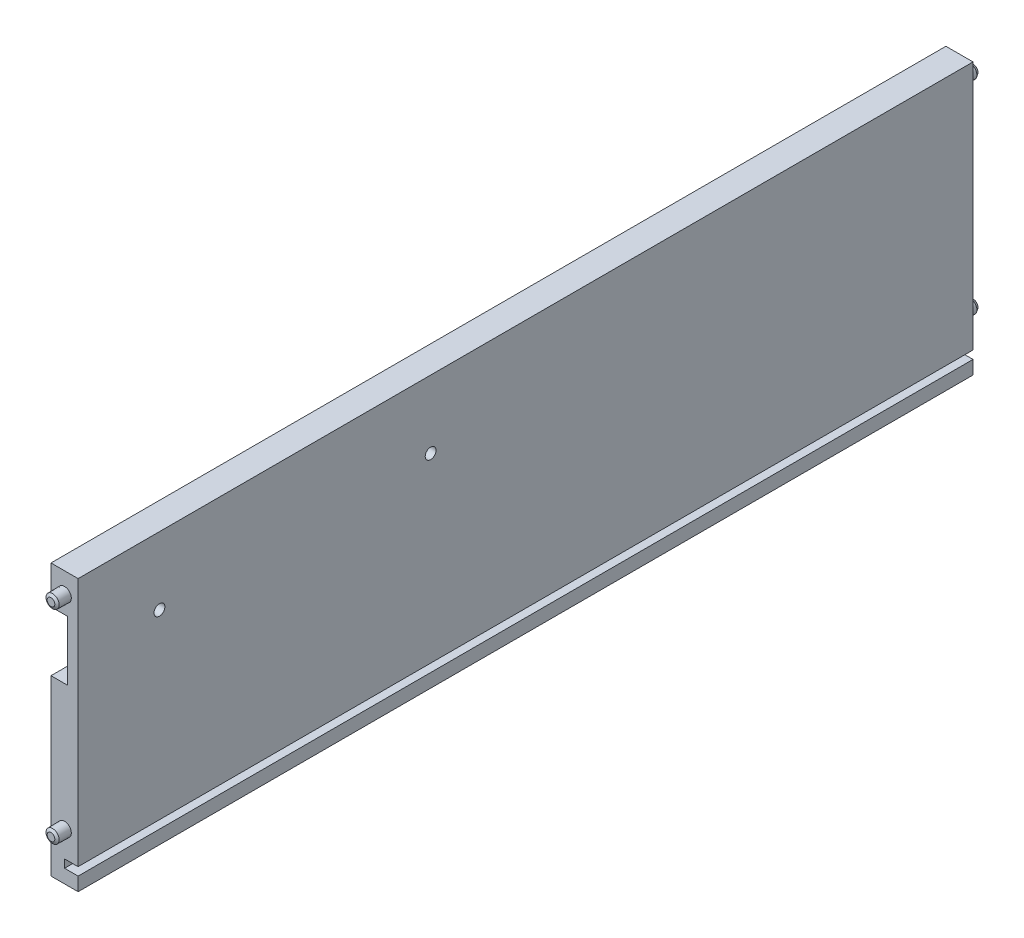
from build123d import *
from OCP.BRepFilletAPI import BRepFilletAPI_MakeChamfer

# Parameters (mm, degrees)
SKETCH1_W                     = 330
SKETCH1_H                     = 100
BOSS_EXTRUDE1_DEPTH           = 10
SKETCH2_W                     = 330
SKETCH2_H                     = 22
CUT_EXTRUDE1_DEPTH            = 6
SKETCH3_R                     = 2
CUT_EXTRUDE2_DEPTH            = 10
SKETCH4_R                     = 2.5
BOSS_EXTRUDE2_DEPTH           = 5
BOSS_EXTRUDE2_DRAFT           = 1
BOSS_EXTRUDE2_PROFILE_2_DEPTH = 5
BOSS_EXTRUDE2_PROFILE_2_DRAFT = 1
MIRROR1_COPY_1_SKETCH_R       = 2.5
MIRROR1_COPY_1_DEPTH          = 5
MIRROR1_COPY_1_DRAFT          = 1
MIRROR1_COPY_2_SKETCH_R       = 2.5
MIRROR1_COPY_2_DEPTH          = 5
MIRROR1_COPY_2_DRAFT          = 1
MIRROR1_COPY_3_SKETCH_R       = 2.5
MIRROR1_COPY_3_DEPTH          = 5
MIRROR1_COPY_3_DRAFT          = 1
CHAMFER1_SIZE                 = 1
CHAMFER1_SIZE2                = 0.583316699
SKETCH5_W                     = 330
SKETCH5_H                     = 3
CUT_EXTRUDE3_DEPTH            = 5


with BuildPart() as part:
    # Sketch1 → Boss-Extrude1 (new body)
    with BuildSketch(Plane(origin=(0, 0, 0), x_dir=(0, 0, -1), z_dir=(1, 0, 0))):
        Rectangle(SKETCH1_W, SKETCH1_H)
    extrude(amount=BOSS_EXTRUDE1_DEPTH)

    # Sketch2 → Cut-Extrude1 (cut)
    with BuildSketch(Plane.ZY):
        with Locations((0, 25)):
            Rectangle(SKETCH2_W, SKETCH2_H)
    extrude(amount=-CUT_EXTRUDE1_DEPTH, mode=Mode.SUBTRACT)

    # Sketch3 → Cut-Extrude2 (cut)
    with BuildSketch(Plane.ZY.offset(-6)):
        with Locations((35, 25)):
            Circle(SKETCH3_R)
        with Locations((135, 25)):
            Circle(SKETCH3_R)
    extrude(amount=-CUT_EXTRUDE2_DEPTH, mode=Mode.SUBTRACT)


with BuildPart() as boss_extrude2_tool:
    # Sketch4 → Boss-Extrude2 (with draft: the straight prism first)
    with BuildSketch(Plane(origin=(0, 0, -165), x_dir=(-1, 0, 0), z_dir=(0, 0, -1))):
        with Locations((-5, 42.5)):
            Circle(SKETCH4_R)
    extrude(amount=BOSS_EXTRUDE2_DEPTH)
    # Boss-Extrude2: the draft: its side faces are tilted about the plane it starts from
    boss_extrude2_sides = [boss_extrude2_tool.faces().sort_by_distance(p)[0] for p in [
        (7.5, 42.5, -167.5),
    ]]
    draft(boss_extrude2_sides, Plane(origin=(0, 0, -165), x_dir=(-1, 0, 0), z_dir=(0, 0, -1)), BOSS_EXTRUDE2_DRAFT)


with BuildPart() as part_1:
    add(part.part)

    # Boss-Extrude2: add boss_extrude2_tool
    add(boss_extrude2_tool.part)


with BuildPart() as boss_extrude2_profile_2_tool:
    # Sketch4 → Boss-Extrude2 profile 2 (with draft: the straight prism first)
    with BuildSketch(Plane(origin=(0, 0, -165), x_dir=(-1, 0, 0), z_dir=(0, 0, -1))):
        with Locations((-5, -32.5)):
            Circle(SKETCH4_R)
    extrude(amount=BOSS_EXTRUDE2_PROFILE_2_DEPTH)
    # Boss-Extrude2 profile 2: the draft: its side faces are tilted about the plane it starts from
    boss_extrude2_profile_2_sides = [boss_extrude2_profile_2_tool.faces().sort_by_distance(p)[0] for p in [
        (7.5, -32.5, -167.5),
    ]]
    draft(boss_extrude2_profile_2_sides, Plane(origin=(0, 0, -165), x_dir=(-1, 0, 0), z_dir=(0, 0, -1)), BOSS_EXTRUDE2_PROFILE_2_DRAFT)


with BuildPart() as part_2:
    add(part_1.part)

    # Boss-Extrude2 profile 2: add boss_extrude2_profile_2_tool
    add(boss_extrude2_profile_2_tool.part)


with BuildPart() as mirror1_copy_1_tool:
    # Mirror1 copy 1 sketch → Mirror1 copy 1 (with draft: the straight prism first)
    with BuildSketch(Plane(origin=(0, 0, 165), x_dir=(-1, 0, 0), z_dir=(0, 0, 1))):
        with Locations((-5, -42.5)):
            Circle(MIRROR1_COPY_1_SKETCH_R)
    extrude(amount=MIRROR1_COPY_1_DEPTH)
    # Mirror1 copy 1: the draft: its side faces are tilted about the plane it starts from
    mirror1_copy_1_sides = [mirror1_copy_1_tool.faces().sort_by_distance(p)[0] for p in [
        (7.5, 42.5, 167.5),
    ]]
    draft(mirror1_copy_1_sides, Plane(origin=(0, 0, 165), x_dir=(-1, 0, 0), z_dir=(0, 0, 1)), MIRROR1_COPY_1_DRAFT)


with BuildPart() as part_3:
    add(part_2.part)

    # Mirror1 copy 1: add mirror1_copy_1_tool
    add(mirror1_copy_1_tool.part)


with BuildPart() as mirror1_copy_2_tool:
    # Mirror1 copy 2 sketch → Mirror1 copy 2 (with draft: the straight prism first)
    with BuildSketch(Plane(origin=(0, 0, 165), x_dir=(-1, 0, 0), z_dir=(0, 0, 1))):
        with Locations((-5, 32.5)):
            Circle(MIRROR1_COPY_2_SKETCH_R)
    extrude(amount=MIRROR1_COPY_2_DEPTH)
    # Mirror1 copy 2: the draft: its side faces are tilted about the plane it starts from
    mirror1_copy_2_sides = [mirror1_copy_2_tool.faces().sort_by_distance(p)[0] for p in [
        (7.5, -32.5, 167.5),
    ]]
    draft(mirror1_copy_2_sides, Plane(origin=(0, 0, 165), x_dir=(-1, 0, 0), z_dir=(0, 0, 1)), MIRROR1_COPY_2_DRAFT)


with BuildPart() as part_4:
    add(part_3.part)

    # Mirror1 copy 2: add mirror1_copy_2_tool
    add(mirror1_copy_2_tool.part)


with BuildPart() as mirror1_copy_3_tool:
    # Mirror1 copy 3 sketch → Mirror1 copy 3 (with draft: the straight prism first)
    with BuildSketch(Plane(origin=(0, 0, 165), x_dir=(-1, 0, 0), z_dir=(0, 0, 1))):
        with Locations((-5, 32.5)):
            Circle(MIRROR1_COPY_3_SKETCH_R)
    extrude(amount=MIRROR1_COPY_3_DEPTH)
    # Mirror1 copy 3: the draft: its side faces are tilted about the plane it starts from
    mirror1_copy_3_sides = [mirror1_copy_3_tool.faces().sort_by_distance(p)[0] for p in [
        (7.5, -32.5, 167.5),
    ]]
    draft(mirror1_copy_3_sides, Plane(origin=(0, 0, 165), x_dir=(-1, 0, 0), z_dir=(0, 0, 1)), MIRROR1_COPY_3_DRAFT)


with BuildPart() as part_5:
    add(part_4.part)

    # Mirror1 copy 3: add mirror1_copy_3_tool
    add(mirror1_copy_3_tool.part)

    # Chamfer1: one chamfer whose edges measure the first distance from different faces: ONE call of the kernel's chamfer builder (chamfer() names one face for all edges)
    chamfer1_edges_1 = [part_5.edges().sort_by_distance(p)[0] for p in [
        (7.412724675, 42.5, -170),
    ]]
    chamfer1_side_1 = [part_5.faces().sort_by_distance(p)[0] for p in [
        (7.456362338, 42.5, -167.5),
    ]]
    chamfer1_edges_2 = [part_5.edges().sort_by_distance(p)[0] for p in [
        (7.412724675, -32.5, -170),
    ]]
    chamfer1_side_2 = [part_5.faces().sort_by_distance(p)[0] for p in [
        (7.456362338, -32.5, -167.5),
    ]]
    chamfer1_edges_3 = [part_5.edges().sort_by_distance(p)[0] for p in [
        (7.412724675, 42.5, 170),
    ]]
    chamfer1_side_3 = [part_5.faces().sort_by_distance(p)[0] for p in [
        (5, 42.5, 170),
    ]]
    chamfer1_edges_4 = [part_5.edges().sort_by_distance(p)[0] for p in [
        (7.412724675, -32.5, 170),
    ]]
    chamfer1_side_4 = [part_5.faces().sort_by_distance(p)[0] for p in [
        (5, -32.5, 170),
    ]]
    chamfer1 = BRepFilletAPI_MakeChamfer(part_5.part.solid().wrapped)
    for e in chamfer1_edges_1:
        chamfer1.Add(CHAMFER1_SIZE, CHAMFER1_SIZE2, e.wrapped, chamfer1_side_1[0].wrapped)  # the first distance lies on this face
    for e in chamfer1_edges_2:
        chamfer1.Add(CHAMFER1_SIZE, CHAMFER1_SIZE2, e.wrapped, chamfer1_side_2[0].wrapped)  # the first distance lies on this face
    for e in chamfer1_edges_3:
        chamfer1.Add(CHAMFER1_SIZE, CHAMFER1_SIZE2, e.wrapped, chamfer1_side_3[0].wrapped)  # the first distance lies on this face
    for e in chamfer1_edges_4:
        chamfer1.Add(CHAMFER1_SIZE, CHAMFER1_SIZE2, e.wrapped, chamfer1_side_4[0].wrapped)  # the first distance lies on this face
    add(Compound.cast(chamfer1.Shape()), mode=Mode.REPLACE)

    # Sketch5 → Cut-Extrude3 (cut)
    with BuildSketch(Plane(origin=(10, 0, 0), x_dir=(0, 0, -1), z_dir=(1, 0, 0))):
        with Locations((0, -43.5)):
            Rectangle(SKETCH5_W, SKETCH5_H)
    extrude(amount=-CUT_EXTRUDE3_DEPTH, mode=Mode.SUBTRACT)


solid = part_5.part
